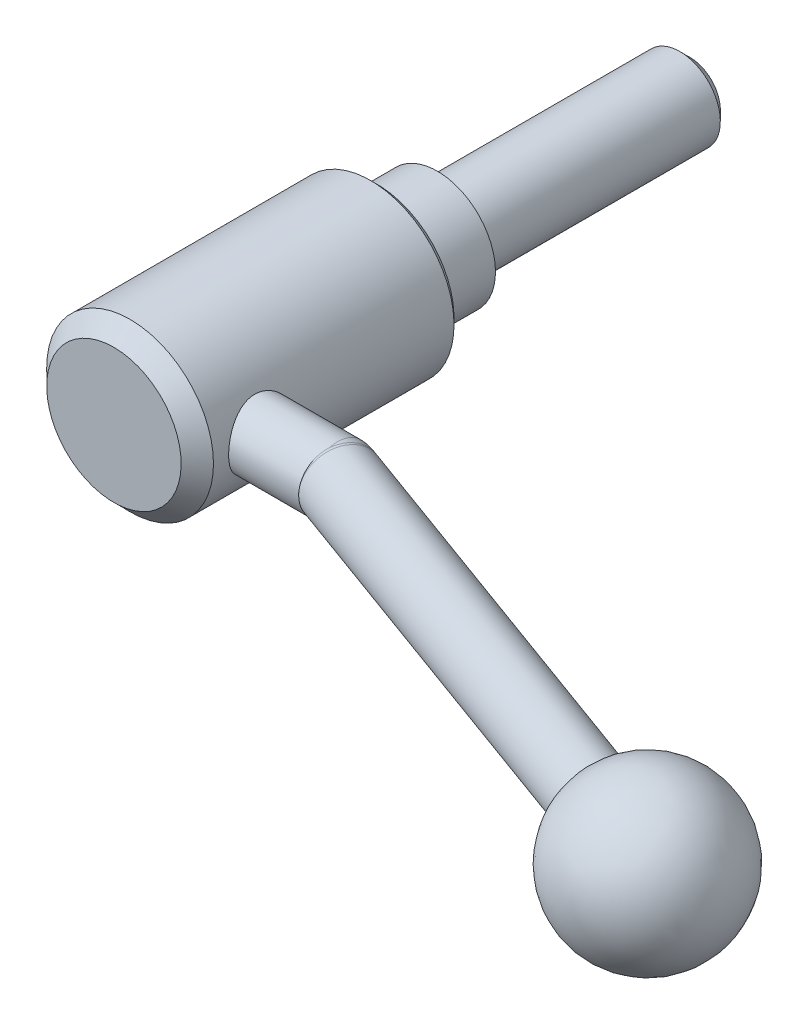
ISO-10303-21;
HEADER;
FILE_DESCRIPTION(('STEP AP214'),'2;1');
FILE_NAME('part.step','',(''),(''),'','','');
FILE_SCHEMA(('AUTOMOTIVE_DESIGN { 1 0 10303 214 1 1 1 1 }'));
ENDSEC;
DATA;
#1=APPLICATION_CONTEXT('core data for automotive mechanical design processes');
#2=APPLICATION_PROTOCOL_DEFINITION('international standard','automotive_design',2000,#1);
#3=PRODUCT_CONTEXT('',#1,'mechanical');
#4=PRODUCT('Part','Part','',(#3));
#5=PRODUCT_RELATED_PRODUCT_CATEGORY('part','',(#4));
#6=PRODUCT_DEFINITION_FORMATION('','',#4);
#7=PRODUCT_DEFINITION_CONTEXT('part definition',#1,'design');
#8=PRODUCT_DEFINITION('design','',#6,#7);
#9=PRODUCT_DEFINITION_SHAPE('','',#8);
#10=(LENGTH_UNIT() NAMED_UNIT(*) SI_UNIT(.MILLI.,.METRE.));
#11=(NAMED_UNIT(*) PLANE_ANGLE_UNIT() SI_UNIT($,.RADIAN.));
#12=(NAMED_UNIT(*) SI_UNIT($,.STERADIAN.) SOLID_ANGLE_UNIT());
#13=UNCERTAINTY_MEASURE_WITH_UNIT(LENGTH_MEASURE(1.E-05),#10,'distance_accuracy_value','');
#14=(GEOMETRIC_REPRESENTATION_CONTEXT(3) GLOBAL_UNCERTAINTY_ASSIGNED_CONTEXT((#13)) GLOBAL_UNIT_ASSIGNED_CONTEXT((#10,
#11,#12)) REPRESENTATION_CONTEXT('',''));
#15=CARTESIAN_POINT('',(0.,0.,0.));
#16=DIRECTION('',(0.,0.,1.));
#17=DIRECTION('',(1.,0.,0.));
#18=AXIS2_PLACEMENT_3D('',#15,#16,#17);
#19=CARTESIAN_POINT('',(0.,0.,-14.386565));
#20=DIRECTION('',(0.,0.,1.));
#21=DIRECTION('',(0.,-1.,0.));
#22=AXIS2_PLACEMENT_3D('',#19,#20,#21);
#23=CYLINDRICAL_SURFACE('',#22,8.);
#24=CARTESIAN_POINT('',(0.,0.,-48.));
#25=DIRECTION('',(0.,0.,-1.));
#26=DIRECTION('',(-1.,0.,0.));
#27=AXIS2_PLACEMENT_3D('',#24,#25,#26);
#28=CIRCLE('',#27,8.);
#29=CARTESIAN_POINT('',(-8.,0.,-48.));
#30=VERTEX_POINT('',#29);
#31=EDGE_CURVE('E9',#30,#30,#28,.F.);
#32=ORIENTED_EDGE('',*,*,#31,.T.);
#33=EDGE_LOOP('',(#32));
#34=FACE_BOUND('',#33,.T.);
#35=CARTESIAN_POINT('',(0.,0.,0.));
#36=DIRECTION('',(0.,0.,1.));
#37=DIRECTION('',(0.,-1.,0.));
#38=AXIS2_PLACEMENT_3D('',#35,#36,#37);
#39=CIRCLE('',#38,8.);
#40=CARTESIAN_POINT('',(0.,-8.,0.));
#41=VERTEX_POINT('',#40);
#42=EDGE_CURVE('E144',#41,#41,#39,.T.);
#43=ORIENTED_EDGE('',*,*,#42,.F.);
#44=EDGE_LOOP('',(#43));
#45=FACE_BOUND('',#44,.T.);
#46=ADVANCED_FACE('F14',(#34,#45),#23,.T.);
#47=CARTESIAN_POINT('',(9.75,0.,0.));
#48=DIRECTION('',(0.,0.,-1.));
#49=DIRECTION('',(0.,1.,0.));
#50=AXIS2_PLACEMENT_3D('',#47,#48,#49);
#51=PLANE('',#50);
#52=ORIENTED_EDGE('',*,*,#42,.T.);
#53=EDGE_LOOP('',(#52));
#54=FACE_BOUND('',#53,.T.);
#55=CARTESIAN_POINT('',(0.,0.,0.));
#56=DIRECTION('',(0.,0.,1.));
#57=DIRECTION('',(0.,-1.,0.));
#58=AXIS2_PLACEMENT_3D('',#55,#56,#57);
#59=CIRCLE('',#58,11.5);
#60=CARTESIAN_POINT('',(0.,-11.5,0.));
#61=VERTEX_POINT('',#60);
#62=EDGE_CURVE('E141',#61,#61,#59,.T.);
#63=ORIENTED_EDGE('',*,*,#62,.F.);
#64=EDGE_LOOP('',(#63));
#65=FACE_BOUND('',#64,.T.);
#66=ADVANCED_FACE('F148',(#54,#65),#51,.T.);
#67=CARTESIAN_POINT('',(0.,0.,6.));
#68=DIRECTION('',(0.,0.,1.));
#69=DIRECTION('',(0.,-1.,0.));
#70=AXIS2_PLACEMENT_3D('',#67,#68,#69);
#71=CYLINDRICAL_SURFACE('',#70,11.5);
#72=CARTESIAN_POINT('',(0.,0.,12.));
#73=DIRECTION('',(0.,0.,1.));
#74=DIRECTION('',(0.,-1.,0.));
#75=AXIS2_PLACEMENT_3D('',#72,#73,#74);
#76=CIRCLE('',#75,11.5);
#77=CARTESIAN_POINT('',(0.,-11.5,12.));
#78=VERTEX_POINT('',#77);
#79=EDGE_CURVE('E136',#78,#78,#76,.T.);
#80=ORIENTED_EDGE('',*,*,#79,.F.);
#81=EDGE_LOOP('',(#80));
#82=FACE_BOUND('',#81,.T.);
#83=ORIENTED_EDGE('',*,*,#62,.T.);
#84=EDGE_LOOP('',(#83));
#85=FACE_BOUND('',#84,.T.);
#86=ADVANCED_FACE('F158',(#82,#85),#71,.T.);
#87=CARTESIAN_POINT('',(13.4,0.,12.));
#88=DIRECTION('',(0.,0.,-1.));
#89=DIRECTION('',(0.,1.,0.));
#90=AXIS2_PLACEMENT_3D('',#87,#88,#89);
#91=PLANE('',#90);
#92=ORIENTED_EDGE('',*,*,#79,.T.);
#93=EDGE_LOOP('',(#92));
#94=FACE_BOUND('',#93,.T.);
#95=CARTESIAN_POINT('',(0.,0.,12.));
#96=DIRECTION('',(0.,0.,1.));
#97=DIRECTION('',(0.,-1.,0.));
#98=AXIS2_PLACEMENT_3D('',#95,#96,#97);
#99=CIRCLE('',#98,15.3);
#100=CARTESIAN_POINT('',(0.,-15.3,12.));
#101=VERTEX_POINT('',#100);
#102=EDGE_CURVE('E134',#101,#101,#99,.T.);
#103=ORIENTED_EDGE('',*,*,#102,.F.);
#104=EDGE_LOOP('',(#103));
#105=FACE_BOUND('',#104,.T.);
#106=ADVANCED_FACE('F163',(#94,#105),#91,.T.);
#107=CARTESIAN_POINT('',(6.65,0.,64.));
#108=DIRECTION('',(0.,0.,1.));
#109=DIRECTION('',(0.,-1.,0.));
#110=AXIS2_PLACEMENT_3D('',#107,#108,#109);
#111=PLANE('',#110);
#112=CARTESIAN_POINT('',(0.,0.,64.));
#113=DIRECTION('',(0.,0.,-1.));
#114=DIRECTION('',(0.,1.,0.));
#115=AXIS2_PLACEMENT_3D('',#112,#113,#114);
#116=CIRCLE('',#115,13.3);
#117=CARTESIAN_POINT('',(0.,13.3,64.));
#118=VERTEX_POINT('',#117);
#119=EDGE_CURVE('E118',#118,#118,#116,.T.);
#120=ORIENTED_EDGE('',*,*,#119,.F.);
#121=EDGE_LOOP('',(#120));
#122=FACE_BOUND('',#121,.T.);
#123=ADVANCED_FACE('F167',(#122),#111,.T.);
#124=CARTESIAN_POINT('',(0.,0.,13.2));
#125=DIRECTION('',(0.,0.,1.));
#126=DIRECTION('',(0.,-1.,0.));
#127=AXIS2_PLACEMENT_3D('',#124,#125,#126);
#128=CONICAL_SURFACE('',#127,16.5,0.785398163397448);
#129=ORIENTED_EDGE('',*,*,#102,.T.);
#130=EDGE_LOOP('',(#129));
#131=FACE_BOUND('',#130,.T.);
#132=CARTESIAN_POINT('',(0.,0.,13.2));
#133=DIRECTION('',(0.,0.,1.));
#134=DIRECTION('',(0.,-1.,0.));
#135=AXIS2_PLACEMENT_3D('',#132,#133,#134);
#136=CIRCLE('',#135,16.5);
#137=CARTESIAN_POINT('',(0.,-16.5,13.2));
#138=VERTEX_POINT('',#137);
#139=EDGE_CURVE('E111',#138,#138,#136,.T.);
#140=ORIENTED_EDGE('',*,*,#139,.F.);
#141=EDGE_LOOP('',(#140));
#142=FACE_BOUND('',#141,.T.);
#143=ADVANCED_FACE('F129',(#131,#142),#128,.T.);
#144=CARTESIAN_POINT('',(0.,0.,60.8));
#145=DIRECTION('',(0.,0.,-1.));
#146=DIRECTION('',(0.,1.,0.));
#147=AXIS2_PLACEMENT_3D('',#144,#145,#146);
#148=CONICAL_SURFACE('',#147,16.5,0.785398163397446);
#149=CARTESIAN_POINT('',(0.,0.,60.8));
#150=DIRECTION('',(0.,0.,1.));
#151=DIRECTION('',(0.,-1.,0.));
#152=AXIS2_PLACEMENT_3D('',#149,#150,#151);
#153=CIRCLE('',#152,16.5);
#154=CARTESIAN_POINT('',(0.,-16.5,60.8));
#155=VERTEX_POINT('',#154);
#156=EDGE_CURVE('E47',#155,#155,#153,.F.);
#157=ORIENTED_EDGE('',*,*,#156,.F.);
#158=EDGE_LOOP('',(#157));
#159=FACE_BOUND('',#158,.T.);
#160=ORIENTED_EDGE('',*,*,#119,.T.);
#161=EDGE_LOOP('',(#160));
#162=FACE_BOUND('',#161,.T.);
#163=ADVANCED_FACE('F126',(#159,#162),#148,.T.);
#164=CARTESIAN_POINT('',(0.,0.,37.));
#165=DIRECTION('',(0.,0.,1.));
#166=DIRECTION('',(0.,-1.,0.));
#167=AXIS2_PLACEMENT_3D('',#164,#165,#166);
#168=CYLINDRICAL_SURFACE('',#167,16.5);
#169=ORIENTED_EDGE('',*,*,#139,.T.);
#170=EDGE_LOOP('',(#169));
#171=FACE_BOUND('',#170,.T.);
#172=ORIENTED_EDGE('',*,*,#156,.T.);
#173=EDGE_LOOP('',(#172));
#174=FACE_BOUND('',#173,.T.);
#175=CARTESIAN_POINT('',(15.1657508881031,-6.5,51.3));
#176=CARTESIAN_POINT('',(15.165745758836,-6.50000508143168,51.1253356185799));
#177=CARTESIAN_POINT('',(15.1687745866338,-6.4929568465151,50.9507222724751));
#178=CARTESIAN_POINT('',(15.1807749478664,-6.46485327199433,50.6027802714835));
#179=CARTESIAN_POINT('',(15.1897474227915,-6.44379571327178,50.4294518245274));
#180=CARTESIAN_POINT('',(15.2133459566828,-6.38788044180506,50.0853414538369));
#181=CARTESIAN_POINT('',(15.2279750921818,-6.35301521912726,49.9145609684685));
#182=CARTESIAN_POINT('',(15.2624132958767,-6.26982978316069,49.5767762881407));
#183=CARTESIAN_POINT('',(15.2822244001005,-6.22150428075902,49.4097736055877));
#184=CARTESIAN_POINT('',(15.3263261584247,-6.1120529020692,49.0812888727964));
#185=CARTESIAN_POINT('',(15.3506010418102,-6.05097199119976,48.919789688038));
#186=CARTESIAN_POINT('',(15.4029664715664,-5.91640387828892,48.6026208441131));
#187=CARTESIAN_POINT('',(15.4310584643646,-5.84291197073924,48.4469534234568));
#188=CARTESIAN_POINT('',(15.4902542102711,-5.68411811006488,48.1424245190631));
#189=CARTESIAN_POINT('',(15.5213571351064,-5.59881940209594,47.9935611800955));
#190=CARTESIAN_POINT('',(15.5857641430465,-5.4169422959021,47.7033239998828));
#191=CARTESIAN_POINT('',(15.6190690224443,-5.32035980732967,47.5619529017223));
#192=CARTESIAN_POINT('',(15.6887193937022,-5.11143835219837,47.2806209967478));
#193=CARTESIAN_POINT('',(15.725133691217,-4.99855381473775,47.14108210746));
#194=CARTESIAN_POINT('',(15.7984639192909,-4.76171225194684,46.8718807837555));
#195=CARTESIAN_POINT('',(15.8353798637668,-4.63775491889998,46.7422186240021));
#196=CARTESIAN_POINT('',(15.9087667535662,-4.37940403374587,46.4934424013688));
#197=CARTESIAN_POINT('',(15.9452374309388,-4.24500452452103,46.3743344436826));
#198=CARTESIAN_POINT('',(16.0167560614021,-3.96663185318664,46.1475194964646));
#199=CARTESIAN_POINT('',(16.0518045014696,-3.8226620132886,46.0398085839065));
#200=CARTESIAN_POINT('',(16.1209091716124,-3.52012556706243,45.8324927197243));
#201=CARTESIAN_POINT('',(16.1548735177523,-3.36120877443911,45.7333671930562));
#202=CARTESIAN_POINT('',(16.219333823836,-3.03493842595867,45.5489784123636));
#203=CARTESIAN_POINT('',(16.2498311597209,-2.86758825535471,45.4637096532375));
#204=CARTESIAN_POINT('',(16.3064735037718,-2.52565072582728,45.3078089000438));
#205=CARTESIAN_POINT('',(16.3326221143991,-2.35106950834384,45.2371647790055));
#206=CARTESIAN_POINT('',(16.3798219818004,-1.99588359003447,45.1111415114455));
#207=CARTESIAN_POINT('',(16.4008745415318,-1.81528044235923,45.0557584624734));
#208=CARTESIAN_POINT('',(16.4454357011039,-1.36695920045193,44.9394592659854));
#209=CARTESIAN_POINT('',(16.4657881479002,-1.09660341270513,44.8872635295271));
#210=CARTESIAN_POINT('',(16.4930664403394,-0.550789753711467,44.8175398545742));
#211=CARTESIAN_POINT('',(16.4999939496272,-0.275332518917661,44.800007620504));
#212=CARTESIAN_POINT('',(16.5000038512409,0.175257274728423,44.7999951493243));
#213=CARTESIAN_POINT('',(16.4972033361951,0.350464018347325,44.8070907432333));
#214=CARTESIAN_POINT('',(16.4860855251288,0.699610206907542,44.8353885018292));
#215=CARTESIAN_POINT('',(16.4777673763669,0.873549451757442,44.8565928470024));
#216=CARTESIAN_POINT('',(16.4558274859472,1.21889636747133,44.9129094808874));
#217=CARTESIAN_POINT('',(16.4422032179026,1.39030279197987,44.9480283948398));
#218=CARTESIAN_POINT('',(16.4100071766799,1.72935619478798,45.0318397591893));
#219=CARTESIAN_POINT('',(16.3914335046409,1.8970017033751,45.0805374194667));
#220=CARTESIAN_POINT('',(16.3498830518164,2.22685454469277,45.1908856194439));
#221=CARTESIAN_POINT('',(16.3269192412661,2.38907628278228,45.2524980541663));
#222=CARTESIAN_POINT('',(16.2771221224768,2.70763704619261,45.3882581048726));
#223=CARTESIAN_POINT('',(16.2502873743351,2.86397385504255,45.4624103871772));
#224=CARTESIAN_POINT('',(16.1934219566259,3.16974182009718,45.6226308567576));
#225=CARTESIAN_POINT('',(16.1633922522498,3.31917504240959,45.7086954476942));
#226=CARTESIAN_POINT('',(16.1008405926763,3.61041938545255,45.892180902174));
#227=CARTESIAN_POINT('',(16.0683177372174,3.752227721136,45.9896058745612));
#228=CARTESIAN_POINT('',(16.0001727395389,4.03314016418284,46.1994336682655));
#229=CARTESIAN_POINT('',(15.9644779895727,4.17188782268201,46.3122902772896));
#230=CARTESIAN_POINT('',(15.892142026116,4.43948611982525,46.5489090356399));
#231=CARTESIAN_POINT('',(15.8555007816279,4.56833643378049,46.6726715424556));
#232=CARTESIAN_POINT('',(15.7821969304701,4.81548386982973,46.9304447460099));
#233=CARTESIAN_POINT('',(15.7455343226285,4.93377545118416,47.0644607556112));
#234=CARTESIAN_POINT('',(15.6731846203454,5.15899919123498,47.3418892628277));
#235=CARTESIAN_POINT('',(15.6374972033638,5.26593514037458,47.4852985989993));
#236=CARTESIAN_POINT('',(15.5665464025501,5.4722064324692,47.7871932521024));
#237=CARTESIAN_POINT('',(15.5313687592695,5.57100992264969,47.9460628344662));
#238=CARTESIAN_POINT('',(15.4642240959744,5.75476702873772,48.2721837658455));
#239=CARTESIAN_POINT('',(15.4322557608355,5.83972632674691,48.4394316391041));
#240=CARTESIAN_POINT('',(15.3725571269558,5.99511642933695,48.7813028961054));
#241=CARTESIAN_POINT('',(15.3448272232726,6.06554587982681,48.9559269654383));
#242=CARTESIAN_POINT('',(15.2945852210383,6.19114229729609,49.311222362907));
#243=CARTESIAN_POINT('',(15.2720705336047,6.24631683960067,49.4918906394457));
#244=CARTESIAN_POINT('',(15.2339240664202,6.33876553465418,49.8499242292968));
#245=CARTESIAN_POINT('',(15.2180336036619,6.37671895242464,50.0270865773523));
#246=CARTESIAN_POINT('',(15.1923255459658,6.43772822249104,50.3843194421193));
#247=CARTESIAN_POINT('',(15.1825052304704,6.4607907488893,50.5643886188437));
#248=CARTESIAN_POINT('',(15.1692851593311,6.49176962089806,50.9260259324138));
#249=CARTESIAN_POINT('',(15.1658841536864,6.49968891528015,51.107593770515));
#250=CARTESIAN_POINT('',(15.1656253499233,6.50029305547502,51.4707553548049));
#251=CARTESIAN_POINT('',(15.1687672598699,6.49297858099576,51.6523490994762));
#252=CARTESIAN_POINT('',(15.1810465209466,6.4642126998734,52.0018533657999));
#253=CARTESIAN_POINT('',(15.1897653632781,6.44374768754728,52.169860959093));
#254=CARTESIAN_POINT('',(15.2125161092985,6.38985201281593,52.5034742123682));
#255=CARTESIAN_POINT('',(15.2265497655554,6.35641707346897,52.6690790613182));
#256=CARTESIAN_POINT('',(15.2594944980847,6.27691602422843,52.9966826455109));
#257=CARTESIAN_POINT('',(15.2784043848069,6.2308529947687,53.158682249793));
#258=CARTESIAN_POINT('',(15.3205529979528,6.12648519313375,53.4781720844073));
#259=CARTESIAN_POINT('',(15.3437933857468,6.06817572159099,53.6356605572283));
#260=CARTESIAN_POINT('',(15.3944388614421,5.93853407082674,53.9482065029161));
#261=CARTESIAN_POINT('',(15.4219169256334,5.86696813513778,54.103155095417));
#262=CARTESIAN_POINT('',(15.4799371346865,5.71212576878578,54.4065474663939));
#263=CARTESIAN_POINT('',(15.5104803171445,5.62884536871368,54.5549890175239));
#264=CARTESIAN_POINT('',(15.573821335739,5.45114518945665,54.8445557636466));
#265=CARTESIAN_POINT('',(15.6066193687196,5.35672443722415,54.9856803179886));
#266=CARTESIAN_POINT('',(15.6736444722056,5.15731826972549,55.2599004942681));
#267=CARTESIAN_POINT('',(15.7078716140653,5.05233232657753,55.392995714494));
#268=CARTESIAN_POINT('',(15.779514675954,4.82413356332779,55.6601446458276));
#269=CARTESIAN_POINT('',(15.8169774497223,4.70014455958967,55.7935237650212));
#270=CARTESIAN_POINT('',(15.8915700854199,4.44140964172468,56.0494187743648));
#271=CARTESIAN_POINT('',(15.9287000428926,4.3066669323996,56.171937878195));
#272=CARTESIAN_POINT('',(16.0016814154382,4.0270441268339,56.4054996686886));
#273=CARTESIAN_POINT('',(16.0375317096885,3.88215545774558,56.5165324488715));
#274=CARTESIAN_POINT('',(16.106952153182,3.58324186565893,56.7262041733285));
#275=CARTESIAN_POINT('',(16.1405232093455,3.42922062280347,56.8248480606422));
#276=CARTESIAN_POINT('',(16.20513395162,3.10977568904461,57.0108780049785));
#277=CARTESIAN_POINT('',(16.2361103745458,2.94418663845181,57.0980025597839));
#278=CARTESIAN_POINT('',(16.293877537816,2.60557789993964,57.2578518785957));
#279=CARTESIAN_POINT('',(16.3206700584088,2.43256141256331,57.3305827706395));
#280=CARTESIAN_POINT('',(16.3692672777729,2.08053032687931,57.4608897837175));
#281=CARTESIAN_POINT('',(16.3910795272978,1.90152528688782,57.5184888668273));
#282=CARTESIAN_POINT('',(16.4291085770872,1.53871493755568,57.6180476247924));
#283=CARTESIAN_POINT('',(16.4453277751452,1.35491172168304,57.6600140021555));
#284=CARTESIAN_POINT('',(16.4721817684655,0.976957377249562,57.7291390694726));
#285=CARTESIAN_POINT('',(16.4825841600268,0.782676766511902,57.7556829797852));
#286=CARTESIAN_POINT('',(16.4964929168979,0.392259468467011,57.7911129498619));
#287=CARTESIAN_POINT('',(16.4999993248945,0.196122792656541,57.7999991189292));
#288=CARTESIAN_POINT('',(16.5000006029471,-0.175160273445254,57.8000007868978));
#289=CARTESIAN_POINT('',(16.4972048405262,-0.350309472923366,57.7929141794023));
#290=CARTESIAN_POINT('',(16.4860972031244,-0.699350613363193,57.7646401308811));
#291=CARTESIAN_POINT('',(16.4777835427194,-0.873242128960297,57.7434481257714));
#292=CARTESIAN_POINT('',(16.4558494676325,-1.21860319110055,57.6871474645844));
#293=CARTESIAN_POINT('',(16.4422234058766,-1.39006995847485,57.6520239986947));
#294=CARTESIAN_POINT('',(16.4100199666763,-1.72924172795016,57.5681936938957));
#295=CARTESIAN_POINT('',(16.3914406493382,-1.89694522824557,57.5194815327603));
#296=CARTESIAN_POINT('',(16.3498814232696,-2.22686723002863,57.4091100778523));
#297=CARTESIAN_POINT('',(16.3269156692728,-2.38910145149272,57.3474923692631));
#298=CARTESIAN_POINT('',(16.2771139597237,-2.70768694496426,57.2117194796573));
#299=CARTESIAN_POINT('',(16.250276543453,-2.86403596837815,57.137559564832));
#300=CARTESIAN_POINT('',(16.1934100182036,-3.16980213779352,56.9773350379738));
#301=CARTESIAN_POINT('',(16.1633823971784,-3.31922246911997,56.8912759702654));
#302=CARTESIAN_POINT('',(16.100835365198,-3.61044218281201,56.7078034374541));
#303=CARTESIAN_POINT('',(16.0683150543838,-3.75223878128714,56.6103858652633));
#304=CARTESIAN_POINT('',(16.0001757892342,-4.03312759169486,56.400575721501));
#305=CARTESIAN_POINT('',(15.9644842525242,-4.17186347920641,56.2877295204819));
#306=CARTESIAN_POINT('',(15.8921547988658,-4.43944004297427,56.0511334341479));
#307=CARTESIAN_POINT('',(15.8555168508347,-4.56828039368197,55.9273831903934));
#308=CARTESIAN_POINT('',(15.7822130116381,-4.81543151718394,55.6696135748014));
#309=CARTESIAN_POINT('',(15.7455471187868,-4.93373489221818,55.5355871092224));
#310=CARTESIAN_POINT('',(15.673190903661,-5.15898035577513,55.2581360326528));
#311=CARTESIAN_POINT('',(15.6375002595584,-5.26592622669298,55.1147145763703));
#312=CARTESIAN_POINT('',(15.5665307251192,-5.47225204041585,54.8127398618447));
#313=CARTESIAN_POINT('',(15.5313383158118,-5.57109554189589,54.6537989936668));
#314=CARTESIAN_POINT('',(15.4641668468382,-5.75492139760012,54.3275284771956));
#315=CARTESIAN_POINT('',(15.4321865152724,-5.83990924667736,54.1602021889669));
#316=CARTESIAN_POINT('',(15.3724986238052,-5.9952660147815,53.8183316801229));
#317=CARTESIAN_POINT('',(15.3447872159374,-6.06564811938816,53.6437941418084));
#318=CARTESIAN_POINT('',(15.2945703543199,-6.191177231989,53.2886684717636));
#319=CARTESIAN_POINT('',(15.2720634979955,-6.24632834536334,53.1080819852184));
#320=CARTESIAN_POINT('',(15.2244373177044,-6.36176485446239,52.6609796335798));
#321=CARTESIAN_POINT('',(15.2025795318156,-6.41349655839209,52.3918451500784));
#322=CARTESIAN_POINT('',(15.1732415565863,-6.48260724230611,51.8484312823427));
#323=CARTESIAN_POINT('',(15.1657589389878,-6.49999202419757,51.574152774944));
#324=CARTESIAN_POINT('',(15.1657508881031,-6.5,51.3));
#325=B_SPLINE_CURVE_WITH_KNOTS('',3,(#175,#176,#177,#178,#179,#180,#181,#182,#183,#184,#185,
#186,#187,#188,#189,#190,#191,#192,#193,#194,#195,#196,#197,#198,#199,#200,#201,#202,#203,#204,
#205,#206,#207,#208,#209,#210,#211,#212,#213,#214,#215,#216,#217,#218,#219,#220,#221,#222,#223,
#224,#225,#226,#227,#228,#229,#230,#231,#232,#233,#234,#235,#236,#237,#238,#239,#240,#241,#242,
#243,#244,#245,#246,#247,#248,#249,#250,#251,#252,#253,#254,#255,#256,#257,#258,#259,#260,#261,
#262,#263,#264,#265,#266,#267,#268,#269,#270,#271,#272,#273,#274,#275,#276,#277,#278,#279,#280,
#281,#282,#283,#284,#285,#286,#287,#288,#289,#290,#291,#292,#293,#294,#295,#296,#297,#298,#299,
#300,#301,#302,#303,#304,#305,#306,#307,#308,#309,#310,#311,#312,#313,#314,#315,#316,#317,#318,
#319,#320,#321,#322,#323,#324),.UNSPECIFIED.,.T.,.F.,(4,2,2,2,2,2,2,2,2,2,2,2,2,2,2,2,2,2,2,2,2,
2,2,2,2,2,2,2,2,2,2,2,2,2,2,2,2,2,2,2,2,2,2,2,2,2,2,2,2,2,2,2,2,2,2,2,2,2,2,2,2,2,2,2,2,2,2,2,2,
2,2,2,2,2,4),(0.,0.523737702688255,1.04755838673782,1.57166436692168,2.09597658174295,
2.61847078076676,3.14116352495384,3.66371288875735,4.18645226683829,4.73526045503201,
5.28408389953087,5.83322277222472,6.38217200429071,6.95251243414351,7.5226257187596,
8.09226434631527,8.66175717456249,9.48746056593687,10.3130616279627,10.8385810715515,
11.3641817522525,11.890032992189,12.4160862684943,12.9406087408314,13.4653268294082,
13.9898868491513,14.5146371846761,15.0611644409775,15.6077096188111,16.1545399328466,
16.7011871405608,17.2715771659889,17.8417324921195,18.4119409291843,18.9818656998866,
19.5267807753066,20.0714514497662,20.6160160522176,21.1605563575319,21.6683825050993,
22.1763762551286,22.6842461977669,23.1923113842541,23.7103778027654,24.228620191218,
24.7469078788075,25.2652214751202,25.8223490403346,26.3793111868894,26.9367497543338,
27.4939651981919,28.0622107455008,28.6302138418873,29.1973499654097,29.7642426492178,
30.352408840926,30.9405713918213,31.4658683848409,31.991335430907,32.5173625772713,
33.0435960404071,33.5681592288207,34.0929208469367,34.6174387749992,35.1421469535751,
35.6886262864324,36.235123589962,36.7820016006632,37.3286969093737,37.8993337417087,
38.4697437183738,39.0396364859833,39.6093754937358,40.4315717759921,41.2536291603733),.UNSPECIFIED.);
#326=CARTESIAN_POINT('',(15.1657508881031,-6.5,51.3));
#327=VERTEX_POINT('',#326);
#328=EDGE_CURVE('E46',#327,#327,#325,.T.);
#329=ORIENTED_EDGE('',*,*,#328,.F.);
#330=EDGE_LOOP('',(#329));
#331=FACE_BOUND('',#330,.T.);
#332=ADVANCED_FACE('F123',(#171,#174,#331),#168,.T.);
#333=CARTESIAN_POINT('',(31.5,0.,51.3));
#334=DIRECTION('',(1.,0.,0.));
#335=DIRECTION('',(0.,0.,1.));
#336=AXIS2_PLACEMENT_3D('',#333,#334,#335);
#337=SPHERICAL_SURFACE('',#336,6.5);
#338=CARTESIAN_POINT('',(31.5,0.,51.3));
#339=DIRECTION('',(-1.,0.,0.));
#340=DIRECTION('',(0.,-1.,0.));
#341=AXIS2_PLACEMENT_3D('',#338,#339,#340);
#342=CIRCLE('',#341,6.5);
#343=CARTESIAN_POINT('',(31.5,6.28033613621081,52.9755232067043));
#344=VERTEX_POINT('',#343);
#345=CARTESIAN_POINT('',(31.5,-6.28033613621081,52.9755232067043));
#346=VERTEX_POINT('',#345);
#347=EDGE_CURVE('E35',#344,#346,#342,.T.);
#348=ORIENTED_EDGE('',*,*,#347,.F.);
#349=CARTESIAN_POINT('',(31.5,-6.28033613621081,52.9755232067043));
#350=CARTESIAN_POINT('',(31.5604115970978,-6.32463778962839,52.8095437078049));
#351=CARTESIAN_POINT('',(31.6214644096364,-6.3614496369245,52.6418024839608));
#352=CARTESIAN_POINT('',(31.7444103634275,-6.41991545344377,52.3040112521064));
#353=CARTESIAN_POINT('',(31.8063034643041,-6.44157014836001,52.133961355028));
#354=CARTESIAN_POINT('',(31.9304500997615,-6.46953783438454,51.7928712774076));
#355=CARTESIAN_POINT('',(31.9927033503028,-6.47586160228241,51.6218318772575));
#356=CARTESIAN_POINT('',(32.1171700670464,-6.47316004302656,51.2798623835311));
#357=CARTESIAN_POINT('',(32.1793835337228,-6.46413490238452,51.1089322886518));
#358=CARTESIAN_POINT('',(32.3033473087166,-6.43079358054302,50.768344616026));
#359=CARTESIAN_POINT('',(32.3650974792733,-6.4064730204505,50.598687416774));
#360=CARTESIAN_POINT('',(32.4877003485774,-6.34269837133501,50.2618388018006));
#361=CARTESIAN_POINT('',(32.5485527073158,-6.30323869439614,50.0946483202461));
#362=CARTESIAN_POINT('',(32.6688696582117,-6.20949357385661,49.764080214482));
#363=CARTESIAN_POINT('',(32.7283350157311,-6.15521652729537,49.6007004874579));
#364=CARTESIAN_POINT('',(32.8455127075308,-6.03218986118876,49.2787574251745));
#365=CARTESIAN_POINT('',(32.9032243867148,-5.96343490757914,49.1201958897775));
#366=CARTESIAN_POINT('',(33.0164417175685,-5.8119796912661,48.809133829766));
#367=CARTESIAN_POINT('',(33.0719481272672,-5.72928427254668,48.6566312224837));
#368=CARTESIAN_POINT('',(33.1804017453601,-5.55048605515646,48.3586573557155));
#369=CARTESIAN_POINT('',(33.2333480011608,-5.45437831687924,48.2131887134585));
#370=CARTESIAN_POINT('',(33.3362716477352,-5.2494843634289,47.9304083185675));
#371=CARTESIAN_POINT('',(33.3862496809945,-5.14070090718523,47.7930948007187));
#372=CARTESIAN_POINT('',(33.4829120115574,-4.91116949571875,47.5275172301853));
#373=CARTESIAN_POINT('',(33.5295950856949,-4.79041713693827,47.3992565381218));
#374=CARTESIAN_POINT('',(33.6192965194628,-4.53789283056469,47.1528038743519));
#375=CARTESIAN_POINT('',(33.662316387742,-4.40612546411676,47.0346077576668));
#376=CARTESIAN_POINT('',(33.7444224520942,-4.13241387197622,46.8090231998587));
#377=CARTESIAN_POINT('',(33.7835071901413,-3.99046590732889,46.7016387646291));
#378=CARTESIAN_POINT('',(33.85743093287,-3.69750906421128,46.4985349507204));
#379=CARTESIAN_POINT('',(33.8922717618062,-3.54650412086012,46.4028105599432));
#380=CARTESIAN_POINT('',(33.9574917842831,-3.23639397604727,46.2236200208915));
#381=CARTESIAN_POINT('',(33.9878693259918,-3.07728580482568,46.1401584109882));
#382=CARTESIAN_POINT('',(34.043921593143,-2.75220747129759,45.9861560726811));
#383=CARTESIAN_POINT('',(34.0695979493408,-2.58623971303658,45.9156108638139));
#384=CARTESIAN_POINT('',(34.1160870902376,-2.2485120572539,45.7878829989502));
#385=CARTESIAN_POINT('',(34.1368980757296,-2.07675004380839,45.7307052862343));
#386=CARTESIAN_POINT('',(34.1734894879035,-1.72875737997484,45.6301712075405));
#387=CARTESIAN_POINT('',(34.1892716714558,-1.55252831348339,45.5868100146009));
#388=CARTESIAN_POINT('',(34.2157095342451,-1.19679469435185,45.5141725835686));
#389=CARTESIAN_POINT('',(34.2263633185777,-1.01728895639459,45.484901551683));
#390=CARTESIAN_POINT('',(34.2504829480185,-0.47589972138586,45.4186334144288));
#391=CARTESIAN_POINT('',(34.256147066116,-0.110762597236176,45.4030713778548));
#392=CARTESIAN_POINT('',(34.2464222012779,0.616910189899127,45.4297902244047));
#393=CARTESIAN_POINT('',(34.2310332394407,0.979445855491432,45.4720710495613));
#394=CARTESIAN_POINT('',(34.1796583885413,1.6918734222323,45.6132222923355));
#395=CARTESIAN_POINT('',(34.1436723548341,2.04176523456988,45.7120931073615));
#396=CARTESIAN_POINT('',(34.0521201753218,2.71889949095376,45.9636306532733));
#397=CARTESIAN_POINT('',(33.9965542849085,3.0461422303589,46.1162966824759));
#398=CARTESIAN_POINT('',(33.8674217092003,3.66870864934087,46.4710855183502));
#399=CARTESIAN_POINT('',(33.7938552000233,3.96403264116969,46.6732078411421));
#400=CARTESIAN_POINT('',(33.6308061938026,4.51438637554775,47.1211813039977));
#401=CARTESIAN_POINT('',(33.541323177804,4.76941480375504,47.3670338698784));
#402=CARTESIAN_POINT('',(33.3489838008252,5.23192699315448,47.8954819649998));
#403=CARTESIAN_POINT('',(33.2461274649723,5.43941084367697,48.1780774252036));
#404=CARTESIAN_POINT('',(33.0299624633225,5.80093835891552,48.7719858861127));
#405=CARTESIAN_POINT('',(32.916654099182,5.9549835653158,49.083298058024));
#406=CARTESIAN_POINT('',(32.6827891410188,6.20528929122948,49.7258367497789));
#407=CARTESIAN_POINT('',(32.5622315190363,6.30154159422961,50.0570660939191));
#408=CARTESIAN_POINT('',(32.3173112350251,6.43346974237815,50.7299790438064));
#409=CARTESIAN_POINT('',(32.1929495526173,6.46916105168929,51.0716599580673));
#410=CARTESIAN_POINT('',(31.9727599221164,6.47789082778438,51.6766259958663));
#411=CARTESIAN_POINT('',(31.876974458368,6.46349392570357,51.9397943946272));
#412=CARTESIAN_POINT('',(31.7344650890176,6.41489914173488,52.3313356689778));
#413=CARTESIAN_POINT('',(31.687169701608,6.39421043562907,52.4612786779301));
#414=CARTESIAN_POINT('',(31.5931272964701,6.34392911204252,52.7196580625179));
#415=CARTESIAN_POINT('',(31.5463803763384,6.31433493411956,52.8480941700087));
#416=CARTESIAN_POINT('',(31.5,6.28033613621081,52.9755232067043));
#417=B_SPLINE_CURVE_WITH_KNOTS('',3,(#349,#350,#351,#352,#353,#354,#355,#356,#357,#358,#359,
#360,#361,#362,#363,#364,#365,#366,#367,#368,#369,#370,#371,#372,#373,#374,#375,#376,#377,#378,
#379,#380,#381,#382,#383,#384,#385,#386,#387,#388,#389,#390,#391,#392,#393,#394,#395,#396,#397,
#398,#399,#400,#401,#402,#403,#404,#405,#406,#407,#408,#409,#410,#411,#412,#413,#414,#415,#416),
.UNSPECIFIED.,.F.,.F.,(4,2,2,2,2,2,2,2,2,2,2,2,2,2,2,2,2,2,2,2,2,2,2,2,2,2,2,2,2,2,2,2,2,4),(0.,
0.546141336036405,1.09225652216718,1.63798770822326,2.1837122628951,2.72959312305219,
3.27567566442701,3.82144937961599,4.36742452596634,4.91321034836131,5.45919771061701,
6.0050664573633,6.55113678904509,7.09698112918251,7.64302697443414,8.18883726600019,
8.73484905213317,9.28067107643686,9.82669462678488,10.3725272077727,10.918561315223,
12.0094472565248,13.100332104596,14.1912246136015,15.2821028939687,16.3729705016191,
17.4638736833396,18.5547748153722,19.645644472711,20.7366691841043,21.827415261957,
22.6662852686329,23.0854882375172,23.5047647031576),.UNSPECIFIED.);
#418=EDGE_CURVE('E49',#346,#344,#417,.T.);
#419=ORIENTED_EDGE('',*,*,#418,.F.);
#420=EDGE_LOOP('',(#348,#419));
#421=FACE_BOUND('',#420,.T.);
#422=ADVANCED_FACE('F50',(#421),#337,.T.);
#423=CARTESIAN_POINT('',(15.75,0.,51.3));
#424=DIRECTION('',(-1.,0.,0.));
#425=DIRECTION('',(0.,-1.,0.));
#426=AXIS2_PLACEMENT_3D('',#423,#424,#425);
#427=CYLINDRICAL_SURFACE('',#426,6.5);
#428=CARTESIAN_POINT('',(30.353874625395,0.,57.8));
#429=CARTESIAN_POINT('',(30.3538760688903,-0.180413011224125,57.8000209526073));
#430=CARTESIAN_POINT('',(30.3551991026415,-0.360822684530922,57.7924896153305));
#431=CARTESIAN_POINT('',(30.3604984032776,-0.72034373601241,57.7624738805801));
#432=CARTESIAN_POINT('',(30.3644745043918,-0.899455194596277,57.7399904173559));
#433=CARTESIAN_POINT('',(30.3750867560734,-1.25500271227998,57.6802401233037));
#434=CARTESIAN_POINT('',(30.3817212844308,-1.43144033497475,57.6429823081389));
#435=CARTESIAN_POINT('',(30.3976715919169,-1.78049689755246,57.5539799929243));
#436=CARTESIAN_POINT('',(30.4069873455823,-1.95311587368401,57.5022356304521));
#437=CARTESIAN_POINT('',(30.42833245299,-2.29333224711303,57.384654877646));
#438=CARTESIAN_POINT('',(30.4403620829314,-2.46092913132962,57.3188170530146));
#439=CARTESIAN_POINT('',(30.4671848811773,-2.7899775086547,57.173532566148));
#440=CARTESIAN_POINT('',(30.481979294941,-2.95142619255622,57.0940797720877));
#441=CARTESIAN_POINT('',(30.5143835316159,-3.26691386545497,56.9222351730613));
#442=CARTESIAN_POINT('',(30.5319923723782,-3.42095541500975,56.8298478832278));
#443=CARTESIAN_POINT('',(30.5701035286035,-3.72055534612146,56.6328784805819));
#444=CARTESIAN_POINT('',(30.5906045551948,-3.86611746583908,56.5283018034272));
#445=CARTESIAN_POINT('',(30.6347023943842,-4.14837693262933,56.3073163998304));
#446=CARTESIAN_POINT('',(30.6583107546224,-4.28503822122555,56.1908639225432));
#447=CARTESIAN_POINT('',(30.7087165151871,-4.5479574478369,55.9473847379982));
#448=CARTESIAN_POINT('',(30.7355139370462,-4.67421531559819,55.8203579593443));
#449=CARTESIAN_POINT('',(30.7925196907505,-4.9155279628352,55.5567044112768));
#450=CARTESIAN_POINT('',(30.8227291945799,-5.0305788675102,55.420074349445));
#451=CARTESIAN_POINT('',(30.8868489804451,-5.24868401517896,55.1383648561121));
#452=CARTESIAN_POINT('',(30.9207592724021,-5.35173822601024,54.9932854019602));
#453=CARTESIAN_POINT('',(30.991944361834,-5.54315969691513,54.6990494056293));
#454=CARTESIAN_POINT('',(31.0291330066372,-5.6317911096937,54.5500436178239));
#455=CARTESIAN_POINT('',(31.1080482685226,-5.79644456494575,54.2463609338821));
#456=CARTESIAN_POINT('',(31.1497744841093,-5.87246772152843,54.0916845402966));
#457=CARTESIAN_POINT('',(31.2164453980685,-5.97675614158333,53.8565126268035));
#458=CARTESIAN_POINT('',(31.2393571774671,-6.00990348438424,53.7775703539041));
#459=CARTESIAN_POINT('',(31.2867125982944,-6.07291452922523,53.6188354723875));
#460=CARTESIAN_POINT('',(31.311156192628,-6.10277833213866,53.5390428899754));
#461=CARTESIAN_POINT('',(31.361785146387,-6.15920167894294,53.3788091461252));
#462=CARTESIAN_POINT('',(31.3879711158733,-6.18576005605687,53.2983677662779));
#463=CARTESIAN_POINT('',(31.4423816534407,-6.23554888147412,53.1371353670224));
#464=CARTESIAN_POINT('',(31.4706064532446,-6.25877895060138,53.0563443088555));
#465=CARTESIAN_POINT('',(31.5,-6.28033613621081,52.9755232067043));
#466=B_SPLINE_CURVE_WITH_KNOTS('',3,(#428,#429,#430,#431,#432,#433,#434,#435,#436,#437,#438,
#439,#440,#441,#442,#443,#444,#445,#446,#447,#448,#449,#450,#451,#452,#453,#454,#455,#456,#457,
#458,#459,#460,#461,#462,#463,#464,#465),.UNSPECIFIED.,.F.,.F.,(4,2,2,2,2,2,2,2,2,2,2,2,2,2,2,2,
2,2,4),(0.,0.541072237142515,1.0821106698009,1.62281945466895,2.16352310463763,2.70428180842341,
3.24528469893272,3.78609920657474,4.32667346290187,4.86931655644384,5.41196331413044,
5.95479703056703,6.49763220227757,7.02900626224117,7.56033334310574,7.82616473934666,
8.09198796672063,8.3579047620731,8.62385182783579),.UNSPECIFIED.);
#467=CARTESIAN_POINT('',(30.3538746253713,0.,57.8));
#468=VERTEX_POINT('',#467);
#469=EDGE_CURVE('E42',#468,#346,#466,.T.);
#470=ORIENTED_EDGE('',*,*,#469,.F.);
#471=CARTESIAN_POINT('',(31.5,6.28033613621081,52.9755232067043));
#472=CARTESIAN_POINT('',(31.4799917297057,6.26566740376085,53.0305088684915));
#473=CARTESIAN_POINT('',(31.4605350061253,6.2502263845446,53.0854833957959));
#474=CARTESIAN_POINT('',(31.422614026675,6.21780122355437,53.1953164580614));
#475=CARTESIAN_POINT('',(31.404149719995,6.20081716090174,53.2501749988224));
#476=CARTESIAN_POINT('',(31.350095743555,6.14756914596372,53.4143861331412));
#477=CARTESIAN_POINT('',(31.315823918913,6.10899372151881,53.5234330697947));
#478=CARTESIAN_POINT('',(31.2502052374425,6.02574752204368,53.7400479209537));
#479=CARTESIAN_POINT('',(31.2188581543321,5.98107721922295,53.8476159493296));
#480=CARTESIAN_POINT('',(31.1586887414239,5.88575616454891,54.0607044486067));
#481=CARTESIAN_POINT('',(31.129864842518,5.8351091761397,54.1662261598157));
#482=CARTESIAN_POINT('',(31.0744189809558,5.72792472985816,54.3748382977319));
#483=CARTESIAN_POINT('',(31.0477971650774,5.67138687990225,54.4779285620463));
#484=CARTESIAN_POINT('',(30.9965376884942,5.55256954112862,54.6812483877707));
#485=CARTESIAN_POINT('',(30.9719000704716,5.49028992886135,54.7814778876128));
#486=CARTESIAN_POINT('',(30.9126002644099,5.327689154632,55.0278762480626));
#487=CARTESIAN_POINT('',(30.8790640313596,5.22388206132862,55.1720360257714));
#488=CARTESIAN_POINT('',(30.8156523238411,5.00438458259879,55.451838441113));
#489=CARTESIAN_POINT('',(30.7857767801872,4.88869442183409,55.5874812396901));
#490=CARTESIAN_POINT('',(30.7294047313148,4.64620709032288,55.8491274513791));
#491=CARTESIAN_POINT('',(30.7029071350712,4.51941352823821,55.9751339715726));
#492=CARTESIAN_POINT('',(30.6530744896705,4.25553131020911,56.2165469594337));
#493=CARTESIAN_POINT('',(30.6297394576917,4.11844259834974,56.3319533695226));
#494=CARTESIAN_POINT('',(30.5858558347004,3.83342873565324,56.5523913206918));
#495=CARTESIAN_POINT('',(30.5653385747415,3.68540613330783,56.657303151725));
#496=CARTESIAN_POINT('',(30.527257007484,3.38076547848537,56.8545811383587));
#497=CARTESIAN_POINT('',(30.5096940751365,3.22414346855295,56.9469414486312));
#498=CARTESIAN_POINT('',(30.4774435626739,2.90342410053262,57.1183503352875));
#499=CARTESIAN_POINT('',(30.4627569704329,2.73932419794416,57.1973943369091));
#500=CARTESIAN_POINT('',(30.4362115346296,2.4049534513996,57.3414668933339));
#501=CARTESIAN_POINT('',(30.4243513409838,2.23468559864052,57.4065021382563));
#502=CARTESIAN_POINT('',(30.4038395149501,1.89629760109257,57.5196908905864));
#503=CARTESIAN_POINT('',(30.3950753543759,1.72838048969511,57.5684319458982));
#504=CARTESIAN_POINT('',(30.3800690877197,1.38906161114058,57.6522477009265));
#505=CARTESIAN_POINT('',(30.373826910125,1.21765994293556,57.6873227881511));
#506=CARTESIAN_POINT('',(30.3638445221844,0.872477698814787,57.7435510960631));
#507=CARTESIAN_POINT('',(30.3601048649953,0.698696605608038,57.764701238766));
#508=CARTESIAN_POINT('',(30.3551204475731,0.349944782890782,57.792935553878));
#509=CARTESIAN_POINT('',(30.3538759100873,0.174973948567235,57.8000184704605));
#510=CARTESIAN_POINT('',(30.353874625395,0.,57.8));
#511=B_SPLINE_CURVE_WITH_KNOTS('',3,(#471,#472,#473,#474,#475,#476,#477,#478,#479,#480,#481,
#482,#483,#484,#485,#486,#487,#488,#489,#490,#491,#492,#493,#494,#495,#496,#497,#498,#499,#500,
#501,#502,#503,#504,#505,#506,#507,#508,#509,#510),.UNSPECIFIED.,.F.,.F.,(4,2,2,2,2,2,2,2,2,2,2,
2,2,2,2,2,2,2,2,4),(0.,0.1809535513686,0.361897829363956,0.723593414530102,1.0852609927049,
1.44670203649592,1.8081671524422,2.16964004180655,2.71132455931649,3.25299883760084,
3.79449771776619,4.3359995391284,4.88310452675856,5.43046343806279,5.97801001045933,
6.52529451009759,7.04991611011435,7.57452283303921,8.09924547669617,8.6240149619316),.UNSPECIFIED.);
#512=EDGE_CURVE('E44',#344,#468,#511,.T.);
#513=ORIENTED_EDGE('',*,*,#512,.F.);
#514=ORIENTED_EDGE('',*,*,#347,.T.);
#515=EDGE_LOOP('',(#470,#513,#514));
#516=FACE_BOUND('',#515,.T.);
#517=ORIENTED_EDGE('',*,*,#328,.T.);
#518=EDGE_LOOP('',(#517));
#519=FACE_BOUND('',#518,.T.);
#520=ADVANCED_FACE('F39',(#516,#519),#427,.T.);
#521=CARTESIAN_POINT('',(32.5770055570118,0.,51.6919979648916));
#522=DIRECTION('',(1.,0.,0.));
#523=DIRECTION('',(0.,0.,1.));
#524=AXIS2_PLACEMENT_3D('',#521,#522,#523);
#525=SPHERICAL_SURFACE('',#524,6.5);
#526=ORIENTED_EDGE('',*,*,#418,.T.);
#527=ORIENTED_EDGE('',*,*,#512,.T.);
#528=CARTESIAN_POINT('',(32.5770055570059,0.,51.6919979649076));
#529=DIRECTION('',(-0.939692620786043,0.,-0.342020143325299));
#530=DIRECTION('',(0.342020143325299,0.,-0.939692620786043));
#531=AXIS2_PLACEMENT_3D('',#528,#529,#530);
#532=CIRCLE('',#531,6.5);
#533=EDGE_CURVE('E55',#468,#468,#532,.F.);
#534=ORIENTED_EDGE('',*,*,#533,.F.);
#535=ORIENTED_EDGE('',*,*,#469,.T.);
#536=EDGE_LOOP('',(#526,#527,#534,#535));
#537=FACE_BOUND('',#536,.T.);
#538=ADVANCED_FACE('F54',(#537),#525,.T.);
#539=CARTESIAN_POINT('',(73.4192597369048,0.,66.557362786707));
#540=DIRECTION('',(-0.939692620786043,0.,-0.342020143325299));
#541=DIRECTION('',(0.342020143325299,0.,-0.939692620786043));
#542=AXIS2_PLACEMENT_3D('',#539,#540,#541);
#543=CYLINDRICAL_SURFACE('',#542,6.5);
#544=ORIENTED_EDGE('',*,*,#533,.T.);
#545=EDGE_LOOP('',(#544));
#546=FACE_BOUND('',#545,.T.);
#547=CARTESIAN_POINT('',(114.261513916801,0.,81.4227276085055));
#548=DIRECTION('',(-0.939692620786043,0.,-0.342020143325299));
#549=DIRECTION('',(0.342020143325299,0.,-0.939692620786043));
#550=AXIS2_PLACEMENT_3D('',#547,#548,#549);
#551=CIRCLE('',#550,6.5);
#552=CARTESIAN_POINT('',(116.484644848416,0.,75.3147255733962));
#553=VERTEX_POINT('',#552);
#554=EDGE_CURVE('E105',#553,#553,#551,.F.);
#555=ORIENTED_EDGE('',*,*,#554,.F.);
#556=EDGE_LOOP('',(#555));
#557=FACE_BOUND('',#556,.T.);
#558=ADVANCED_FACE('F81',(#546,#557),#543,.T.);
#559=CARTESIAN_POINT('',(128.,0.,86.4231276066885));
#560=DIRECTION('',(1.,0.,0.));
#561=DIRECTION('',(0.,0.,1.));
#562=AXIS2_PLACEMENT_3D('',#559,#560,#561);
#563=SPHERICAL_SURFACE('',#562,16.);
#564=CARTESIAN_POINT('',(144.,0.,86.4231276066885));
#565=VERTEX_POINT('',#564);
#566=VERTEX_LOOP('',#565);
#567=FACE_BOUND('',#566,.T.);
#568=ORIENTED_EDGE('',*,*,#554,.T.);
#569=EDGE_LOOP('',(#568));
#570=FACE_BOUND('',#569,.T.);
#571=ADVANCED_FACE('F90',(#567,#570),#563,.T.);
#572=CARTESIAN_POINT('',(0.,0.,-50.));
#573=DIRECTION('',(0.,0.,-1.));
#574=DIRECTION('',(-1.,0.,0.));
#575=AXIS2_PLACEMENT_3D('',#572,#573,#574);
#576=PLANE('',#575);
#577=CARTESIAN_POINT('',(0.,0.,-50.));
#578=DIRECTION('',(0.,0.,-1.));
#579=DIRECTION('',(-1.,0.,0.));
#580=AXIS2_PLACEMENT_3D('',#577,#578,#579);
#581=CIRCLE('',#580,6.);
#582=CARTESIAN_POINT('',(-6.,0.,-50.));
#583=VERTEX_POINT('',#582);
#584=EDGE_CURVE('E23',#583,#583,#581,.T.);
#585=ORIENTED_EDGE('',*,*,#584,.T.);
#586=EDGE_LOOP('',(#585));
#587=FACE_BOUND('',#586,.T.);
#588=ADVANCED_FACE('F92',(#587),#576,.T.);
#589=CARTESIAN_POINT('',(0.,0.,-50.));
#590=DIRECTION('',(0.,0.,1.));
#591=DIRECTION('',(1.,0.,0.));
#592=AXIS2_PLACEMENT_3D('',#589,#590,#591);
#593=CONICAL_SURFACE('',#592,6.,0.78539816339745);
#594=ORIENTED_EDGE('',*,*,#31,.F.);
#595=EDGE_LOOP('',(#594));
#596=FACE_BOUND('',#595,.T.);
#597=ORIENTED_EDGE('',*,*,#584,.F.);
#598=EDGE_LOOP('',(#597));
#599=FACE_BOUND('',#598,.T.);
#600=ADVANCED_FACE('F16',(#596,#599),#593,.T.);
#601=CLOSED_SHELL('',(#46,#66,#86,#106,#123,#143,#163,#332,#422,#520,#538,#558,#571,#588,#600));
#602=MANIFOLD_SOLID_BREP('B1',#601);
#603=ADVANCED_BREP_SHAPE_REPRESENTATION('',(#18,#602),#14);
#604=SHAPE_DEFINITION_REPRESENTATION(#9,#603);
ENDSEC;
END-ISO-10303-21;
